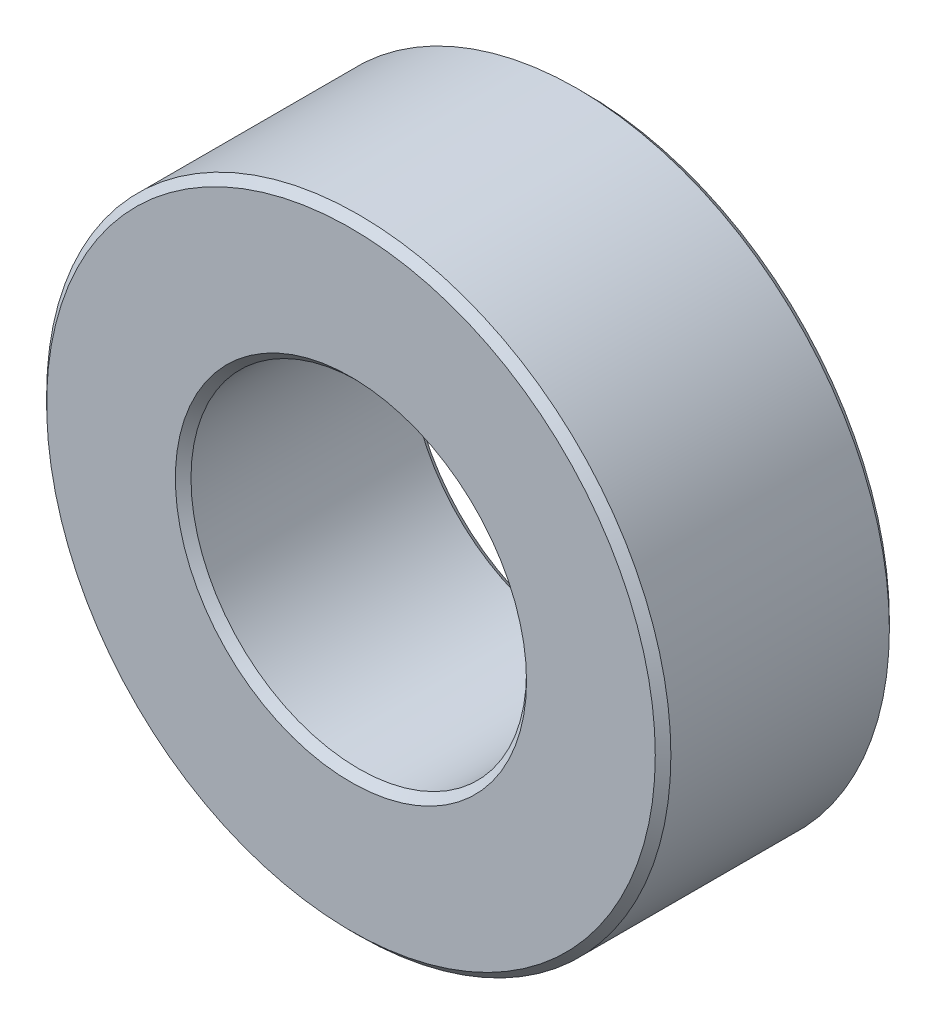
ISO-10303-21;
HEADER;
FILE_DESCRIPTION(('STEP AP214'),'2;1');
FILE_NAME('part.step','',(''),(''),'','','');
FILE_SCHEMA(('AUTOMOTIVE_DESIGN { 1 0 10303 214 1 1 1 1 }'));
ENDSEC;
DATA;
#1=APPLICATION_CONTEXT('core data for automotive mechanical design processes');
#2=APPLICATION_PROTOCOL_DEFINITION('international standard','automotive_design',2000,#1);
#3=PRODUCT_CONTEXT('',#1,'mechanical');
#4=PRODUCT('Part','Part','',(#3));
#5=PRODUCT_RELATED_PRODUCT_CATEGORY('part','',(#4));
#6=PRODUCT_DEFINITION_FORMATION('','',#4);
#7=PRODUCT_DEFINITION_CONTEXT('part definition',#1,'design');
#8=PRODUCT_DEFINITION('design','',#6,#7);
#9=PRODUCT_DEFINITION_SHAPE('','',#8);
#10=(LENGTH_UNIT() NAMED_UNIT(*) SI_UNIT(.MILLI.,.METRE.));
#11=(NAMED_UNIT(*) PLANE_ANGLE_UNIT() SI_UNIT($,.RADIAN.));
#12=(NAMED_UNIT(*) SI_UNIT($,.STERADIAN.) SOLID_ANGLE_UNIT());
#13=UNCERTAINTY_MEASURE_WITH_UNIT(LENGTH_MEASURE(1.E-05),#10,'distance_accuracy_value','');
#14=(GEOMETRIC_REPRESENTATION_CONTEXT(3) GLOBAL_UNCERTAINTY_ASSIGNED_CONTEXT((#13)) GLOBAL_UNIT_ASSIGNED_CONTEXT((#10,
#11,#12)) REPRESENTATION_CONTEXT('',''));
#15=CARTESIAN_POINT('',(0.,0.,0.));
#16=DIRECTION('',(0.,0.,1.));
#17=DIRECTION('',(1.,0.,0.));
#18=AXIS2_PLACEMENT_3D('',#15,#16,#17);
#19=CARTESIAN_POINT('',(0.,0.,1.5));
#20=DIRECTION('',(0.,0.,1.));
#21=DIRECTION('',(1.,0.,0.));
#22=AXIS2_PLACEMENT_3D('',#19,#20,#21);
#23=PLANE('',#22);
#24=CARTESIAN_POINT('',(0.,0.,1.5));
#25=DIRECTION('',(0.,0.,1.));
#26=DIRECTION('',(1.,0.,0.));
#27=AXIS2_PLACEMENT_3D('',#24,#25,#26);
#28=CIRCLE('',#27,2.25);
#29=CARTESIAN_POINT('',(2.25,0.,1.5));
#30=VERTEX_POINT('',#29);
#31=EDGE_CURVE('E10',#30,#30,#28,.F.);
#32=ORIENTED_EDGE('',*,*,#31,.T.);
#33=EDGE_LOOP('',(#32));
#34=FACE_BOUND('',#33,.T.);
#35=CARTESIAN_POINT('',(0.,0.,1.5));
#36=DIRECTION('',(0.,0.,1.));
#37=DIRECTION('',(1.,0.,0.));
#38=AXIS2_PLACEMENT_3D('',#35,#36,#37);
#39=CIRCLE('',#38,3.9);
#40=CARTESIAN_POINT('',(3.9,0.,1.5));
#41=VERTEX_POINT('',#40);
#42=EDGE_CURVE('E45',#41,#41,#39,.T.);
#43=ORIENTED_EDGE('',*,*,#42,.T.);
#44=EDGE_LOOP('',(#43));
#45=FACE_BOUND('',#44,.T.);
#46=ADVANCED_FACE('F37',(#34,#45),#23,.T.);
#47=CARTESIAN_POINT('',(0.,0.,-1.5));
#48=DIRECTION('',(0.,0.,1.));
#49=DIRECTION('',(1.,0.,0.));
#50=AXIS2_PLACEMENT_3D('',#47,#48,#49);
#51=PLANE('',#50);
#52=CARTESIAN_POINT('',(0.,0.,-1.5));
#53=DIRECTION('',(0.,0.,1.));
#54=DIRECTION('',(1.,0.,0.));
#55=AXIS2_PLACEMENT_3D('',#52,#53,#54);
#56=CIRCLE('',#55,3.9);
#57=CARTESIAN_POINT('',(3.9,0.,-1.5));
#58=VERTEX_POINT('',#57);
#59=EDGE_CURVE('E63',#58,#58,#56,.F.);
#60=ORIENTED_EDGE('',*,*,#59,.T.);
#61=EDGE_LOOP('',(#60));
#62=FACE_BOUND('',#61,.T.);
#63=CARTESIAN_POINT('',(0.,0.,-1.5));
#64=DIRECTION('',(0.,0.,1.));
#65=DIRECTION('',(1.,0.,0.));
#66=AXIS2_PLACEMENT_3D('',#63,#64,#65);
#67=CIRCLE('',#66,2.25);
#68=CARTESIAN_POINT('',(2.25,0.,-1.5));
#69=VERTEX_POINT('',#68);
#70=EDGE_CURVE('E66',#69,#69,#67,.T.);
#71=ORIENTED_EDGE('',*,*,#70,.T.);
#72=EDGE_LOOP('',(#71));
#73=FACE_BOUND('',#72,.T.);
#74=ADVANCED_FACE('F89',(#62,#73),#51,.F.);
#75=CARTESIAN_POINT('',(0.,0.,1.5));
#76=DIRECTION('',(0.,0.,-1.));
#77=DIRECTION('',(-1.,0.,0.));
#78=AXIS2_PLACEMENT_3D('',#75,#76,#77);
#79=CYLINDRICAL_SURFACE('',#78,4.);
#80=CARTESIAN_POINT('',(0.,0.,-1.4));
#81=DIRECTION('',(0.,0.,1.));
#82=DIRECTION('',(1.,0.,0.));
#83=AXIS2_PLACEMENT_3D('',#80,#81,#82);
#84=CIRCLE('',#83,4.);
#85=CARTESIAN_POINT('',(4.,0.,-1.4));
#86=VERTEX_POINT('',#85);
#87=EDGE_CURVE('E70',#86,#86,#84,.T.);
#88=ORIENTED_EDGE('',*,*,#87,.T.);
#89=EDGE_LOOP('',(#88));
#90=FACE_BOUND('',#89,.T.);
#91=CARTESIAN_POINT('',(0.,0.,1.4));
#92=DIRECTION('',(0.,0.,1.));
#93=DIRECTION('',(1.,0.,0.));
#94=AXIS2_PLACEMENT_3D('',#91,#92,#93);
#95=CIRCLE('',#94,4.);
#96=CARTESIAN_POINT('',(4.,0.,1.4));
#97=VERTEX_POINT('',#96);
#98=EDGE_CURVE('E74',#97,#97,#95,.F.);
#99=ORIENTED_EDGE('',*,*,#98,.T.);
#100=EDGE_LOOP('',(#99));
#101=FACE_BOUND('',#100,.T.);
#102=ADVANCED_FACE('F78',(#90,#101),#79,.T.);
#103=CARTESIAN_POINT('',(0.,0.,1.5));
#104=DIRECTION('',(0.,0.,-1.));
#105=DIRECTION('',(-1.,0.,0.));
#106=AXIS2_PLACEMENT_3D('',#103,#104,#105);
#107=CYLINDRICAL_SURFACE('',#106,2.15);
#108=CARTESIAN_POINT('',(0.,0.,-1.4));
#109=DIRECTION('',(0.,0.,1.));
#110=DIRECTION('',(1.,0.,0.));
#111=AXIS2_PLACEMENT_3D('',#108,#109,#110);
#112=CIRCLE('',#111,2.15);
#113=CARTESIAN_POINT('',(2.15,0.,-1.4));
#114=VERTEX_POINT('',#113);
#115=EDGE_CURVE('E51',#114,#114,#112,.F.);
#116=ORIENTED_EDGE('',*,*,#115,.T.);
#117=EDGE_LOOP('',(#116));
#118=FACE_BOUND('',#117,.T.);
#119=CARTESIAN_POINT('',(0.,0.,1.4));
#120=DIRECTION('',(0.,0.,1.));
#121=DIRECTION('',(1.,0.,0.));
#122=AXIS2_PLACEMENT_3D('',#119,#120,#121);
#123=CIRCLE('',#122,2.15);
#124=CARTESIAN_POINT('',(2.15,0.,1.4));
#125=VERTEX_POINT('',#124);
#126=EDGE_CURVE('E57',#125,#125,#123,.T.);
#127=ORIENTED_EDGE('',*,*,#126,.T.);
#128=EDGE_LOOP('',(#127));
#129=FACE_BOUND('',#128,.T.);
#130=ADVANCED_FACE('F97',(#118,#129),#107,.F.);
#131=CARTESIAN_POINT('',(0.,0.,-1.4));
#132=DIRECTION('',(0.,0.,1.));
#133=DIRECTION('',(1.,0.,0.));
#134=AXIS2_PLACEMENT_3D('',#131,#132,#133);
#135=CONICAL_SURFACE('',#134,4.,0.785398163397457);
#136=ORIENTED_EDGE('',*,*,#59,.F.);
#137=EDGE_LOOP('',(#136));
#138=FACE_BOUND('',#137,.T.);
#139=ORIENTED_EDGE('',*,*,#87,.F.);
#140=EDGE_LOOP('',(#139));
#141=FACE_BOUND('',#140,.T.);
#142=ADVANCED_FACE('F102',(#138,#141),#135,.T.);
#143=CARTESIAN_POINT('',(0.,0.,-1.5));
#144=DIRECTION('',(0.,0.,-1.));
#145=DIRECTION('',(-1.,0.,0.));
#146=AXIS2_PLACEMENT_3D('',#143,#144,#145);
#147=CONICAL_SURFACE('',#146,2.25,0.785398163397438);
#148=ORIENTED_EDGE('',*,*,#115,.F.);
#149=EDGE_LOOP('',(#148));
#150=FACE_BOUND('',#149,.T.);
#151=ORIENTED_EDGE('',*,*,#70,.F.);
#152=EDGE_LOOP('',(#151));
#153=FACE_BOUND('',#152,.T.);
#154=ADVANCED_FACE('F86',(#150,#153),#147,.F.);
#155=CARTESIAN_POINT('',(0.,0.,1.4));
#156=DIRECTION('',(0.,0.,1.));
#157=DIRECTION('',(1.,0.,0.));
#158=AXIS2_PLACEMENT_3D('',#155,#156,#157);
#159=CONICAL_SURFACE('',#158,2.15,0.78539816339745);
#160=ORIENTED_EDGE('',*,*,#31,.F.);
#161=EDGE_LOOP('',(#160));
#162=FACE_BOUND('',#161,.T.);
#163=ORIENTED_EDGE('',*,*,#126,.F.);
#164=EDGE_LOOP('',(#163));
#165=FACE_BOUND('',#164,.T.);
#166=ADVANCED_FACE('F82',(#162,#165),#159,.F.);
#167=CARTESIAN_POINT('',(0.,0.,1.5));
#168=DIRECTION('',(0.,0.,-1.));
#169=DIRECTION('',(-1.,0.,0.));
#170=AXIS2_PLACEMENT_3D('',#167,#168,#169);
#171=CONICAL_SURFACE('',#170,3.9,0.785398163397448);
#172=ORIENTED_EDGE('',*,*,#98,.F.);
#173=EDGE_LOOP('',(#172));
#174=FACE_BOUND('',#173,.T.);
#175=ORIENTED_EDGE('',*,*,#42,.F.);
#176=EDGE_LOOP('',(#175));
#177=FACE_BOUND('',#176,.T.);
#178=ADVANCED_FACE('F39',(#174,#177),#171,.T.);
#179=CLOSED_SHELL('',(#46,#74,#102,#130,#142,#154,#166,#178));
#180=MANIFOLD_SOLID_BREP('B2',#179);
#181=ADVANCED_BREP_SHAPE_REPRESENTATION('',(#18,#180),#14);
#182=SHAPE_DEFINITION_REPRESENTATION(#9,#181);
ENDSEC;
END-ISO-10303-21;
